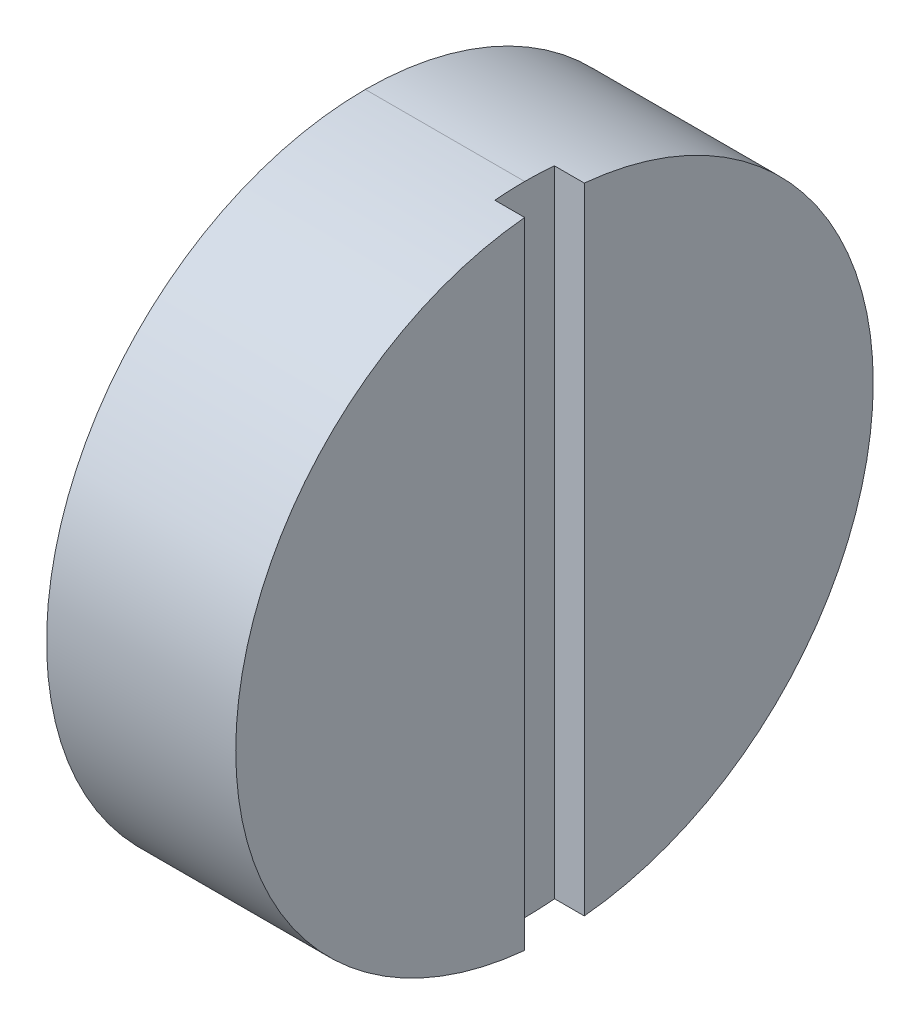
ISO-10303-21;
HEADER;
FILE_DESCRIPTION(('STEP AP214'),'2;1');
FILE_NAME('part.step','',(''),(''),'','','');
FILE_SCHEMA(('AUTOMOTIVE_DESIGN { 1 0 10303 214 1 1 1 1 }'));
ENDSEC;
DATA;
#1=APPLICATION_CONTEXT('core data for automotive mechanical design processes');
#2=APPLICATION_PROTOCOL_DEFINITION('international standard','automotive_design',2000,#1);
#3=PRODUCT_CONTEXT('',#1,'mechanical');
#4=PRODUCT('Part','Part','',(#3));
#5=PRODUCT_RELATED_PRODUCT_CATEGORY('part','',(#4));
#6=PRODUCT_DEFINITION_FORMATION('','',#4);
#7=PRODUCT_DEFINITION_CONTEXT('part definition',#1,'design');
#8=PRODUCT_DEFINITION('design','',#6,#7);
#9=PRODUCT_DEFINITION_SHAPE('','',#8);
#10=(LENGTH_UNIT() NAMED_UNIT(*) SI_UNIT(.MILLI.,.METRE.));
#11=(NAMED_UNIT(*) PLANE_ANGLE_UNIT() SI_UNIT($,.RADIAN.));
#12=(NAMED_UNIT(*) SI_UNIT($,.STERADIAN.) SOLID_ANGLE_UNIT());
#13=UNCERTAINTY_MEASURE_WITH_UNIT(LENGTH_MEASURE(1.E-05),#10,'distance_accuracy_value','');
#14=(GEOMETRIC_REPRESENTATION_CONTEXT(3) GLOBAL_UNCERTAINTY_ASSIGNED_CONTEXT((#13)) GLOBAL_UNIT_ASSIGNED_CONTEXT((#10,
#11,#12)) REPRESENTATION_CONTEXT('',''));
#15=CARTESIAN_POINT('',(0.,0.,0.));
#16=DIRECTION('',(0.,0.,1.));
#17=DIRECTION('',(1.,0.,0.));
#18=AXIS2_PLACEMENT_3D('',#15,#16,#17);
#19=CARTESIAN_POINT('',(43.1292,40.6146,14.605));
#20=DIRECTION('',(-1.,0.,0.));
#21=DIRECTION('',(0.,-1.,0.));
#22=AXIS2_PLACEMENT_3D('',#19,#20,#21);
#23=PLANE('',#22);
#24=CARTESIAN_POINT('',(43.1291999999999,35.179,15.113));
#25=DIRECTION('',(1.,0.,0.));
#26=DIRECTION('',(0.,1.,0.));
#27=AXIS2_PLACEMENT_3D('',#24,#25,#26);
#28=CIRCLE('',#27,5.4356);
#29=CARTESIAN_POINT('',(43.1291999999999,29.7671903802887,14.605));
#30=VERTEX_POINT('',#29);
#31=CARTESIAN_POINT('',(43.1291999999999,29.7434,15.113));
#32=VERTEX_POINT('',#31);
#33=EDGE_CURVE('E105',#30,#32,#28,.F.);
#34=ORIENTED_EDGE('',*,*,#33,.F.);
#35=DIRECTION('',(0.,1.,0.));
#36=VECTOR('',#35,1.);
#37=CARTESIAN_POINT('',(43.1291999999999,40.6146,14.605));
#38=LINE('',#37,#36);
#39=CARTESIAN_POINT('',(43.1291999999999,40.5908096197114,14.605));
#40=VERTEX_POINT('',#39);
#41=EDGE_CURVE('E92',#30,#40,#38,.T.);
#42=ORIENTED_EDGE('',*,*,#41,.T.);
#43=CARTESIAN_POINT('',(43.1291999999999,35.179,15.113));
#44=DIRECTION('',(1.,0.,0.));
#45=DIRECTION('',(0.,1.,0.));
#46=AXIS2_PLACEMENT_3D('',#43,#44,#45);
#47=CIRCLE('',#46,5.4356);
#48=CARTESIAN_POINT('',(43.1291999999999,40.6146,15.113));
#49=VERTEX_POINT('',#48);
#50=EDGE_CURVE('E70',#49,#40,#47,.F.);
#51=ORIENTED_EDGE('',*,*,#50,.F.);
#52=CARTESIAN_POINT('',(43.1291999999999,35.179,15.113));
#53=DIRECTION('',(1.,0.,0.));
#54=DIRECTION('',(0.,1.,0.));
#55=AXIS2_PLACEMENT_3D('',#52,#53,#54);
#56=CIRCLE('',#55,5.4356);
#57=CARTESIAN_POINT('',(43.1291999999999,40.5908096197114,15.621));
#58=VERTEX_POINT('',#57);
#59=EDGE_CURVE('E20',#58,#49,#56,.F.);
#60=ORIENTED_EDGE('',*,*,#59,.F.);
#61=DIRECTION('',(0.,1.,0.));
#62=VECTOR('',#61,1.);
#63=CARTESIAN_POINT('',(43.1292,29.7434000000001,15.621));
#64=LINE('',#63,#62);
#65=CARTESIAN_POINT('',(43.1291999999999,29.7671903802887,15.621));
#66=VERTEX_POINT('',#65);
#67=EDGE_CURVE('E68',#58,#66,#64,.F.);
#68=ORIENTED_EDGE('',*,*,#67,.T.);
#69=CARTESIAN_POINT('',(43.1291999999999,35.179,15.113));
#70=DIRECTION('',(1.,0.,0.));
#71=DIRECTION('',(0.,1.,0.));
#72=AXIS2_PLACEMENT_3D('',#69,#70,#71);
#73=CIRCLE('',#72,5.4356);
#74=EDGE_CURVE('E94',#32,#66,#73,.F.);
#75=ORIENTED_EDGE('',*,*,#74,.F.);
#76=EDGE_LOOP('',(#34,#42,#51,#60,#68,#75));
#77=FACE_BOUND('',#76,.T.);
#78=ADVANCED_FACE('F17',(#77),#23,.F.);
#79=CARTESIAN_POINT('',(43.6372,40.6146,14.605));
#80=DIRECTION('',(0.,0.,-1.));
#81=DIRECTION('',(-1.,0.,0.));
#82=AXIS2_PLACEMENT_3D('',#79,#80,#81);
#83=PLANE('',#82);
#84=DIRECTION('',(0.,1.,0.));
#85=VECTOR('',#84,1.);
#86=CARTESIAN_POINT('',(43.6371999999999,35.179,14.605));
#87=LINE('',#86,#85);
#88=CARTESIAN_POINT('',(43.6372,40.5908096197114,14.605));
#89=VERTEX_POINT('',#88);
#90=CARTESIAN_POINT('',(43.6371999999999,29.7671903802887,14.605));
#91=VERTEX_POINT('',#90);
#92=EDGE_CURVE('E115',#89,#91,#87,.F.);
#93=ORIENTED_EDGE('',*,*,#92,.F.);
#94=DIRECTION('',(-1.,0.,0.));
#95=VECTOR('',#94,1.);
#96=CARTESIAN_POINT('',(43.6372,40.5908096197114,14.605));
#97=LINE('',#96,#95);
#98=EDGE_CURVE('E87',#40,#89,#97,.F.);
#99=ORIENTED_EDGE('',*,*,#98,.F.);
#100=ORIENTED_EDGE('',*,*,#41,.F.);
#101=DIRECTION('',(-1.,0.,0.));
#102=VECTOR('',#101,1.);
#103=CARTESIAN_POINT('',(43.6372,29.7671903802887,14.605));
#104=LINE('',#103,#102);
#105=EDGE_CURVE('E84',#91,#30,#104,.T.);
#106=ORIENTED_EDGE('',*,*,#105,.F.);
#107=EDGE_LOOP('',(#93,#99,#100,#106));
#108=FACE_BOUND('',#107,.T.);
#109=ADVANCED_FACE('F113',(#108),#83,.F.);
#110=CARTESIAN_POINT('',(43.6371999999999,29.7434000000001,15.621));
#111=DIRECTION('',(0.,0.,1.));
#112=DIRECTION('',(1.,0.,0.));
#113=AXIS2_PLACEMENT_3D('',#110,#111,#112);
#114=PLANE('',#113);
#115=ORIENTED_EDGE('',*,*,#67,.F.);
#116=DIRECTION('',(1.,0.,0.));
#117=VECTOR('',#116,1.);
#118=CARTESIAN_POINT('',(43.6371999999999,40.5908096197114,15.621));
#119=LINE('',#118,#117);
#120=CARTESIAN_POINT('',(43.6372,40.5908096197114,15.621));
#121=VERTEX_POINT('',#120);
#122=EDGE_CURVE('E76',#121,#58,#119,.F.);
#123=ORIENTED_EDGE('',*,*,#122,.F.);
#124=DIRECTION('',(0.,1.,0.));
#125=VECTOR('',#124,1.);
#126=CARTESIAN_POINT('',(43.6371999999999,35.179,15.621));
#127=LINE('',#126,#125);
#128=CARTESIAN_POINT('',(43.6371999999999,29.7671903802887,15.621));
#129=VERTEX_POINT('',#128);
#130=EDGE_CURVE('E103',#129,#121,#127,.T.);
#131=ORIENTED_EDGE('',*,*,#130,.F.);
#132=DIRECTION('',(1.,0.,0.));
#133=VECTOR('',#132,1.);
#134=CARTESIAN_POINT('',(43.6371999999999,29.7671903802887,15.621));
#135=LINE('',#134,#133);
#136=EDGE_CURVE('E78',#66,#129,#135,.T.);
#137=ORIENTED_EDGE('',*,*,#136,.F.);
#138=EDGE_LOOP('',(#115,#123,#131,#137));
#139=FACE_BOUND('',#138,.T.);
#140=ADVANCED_FACE('F74',(#139),#114,.F.);
#141=CARTESIAN_POINT('',(43.6371999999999,35.179,15.113));
#142=DIRECTION('',(1.,0.,0.));
#143=DIRECTION('',(0.,1.,0.));
#144=AXIS2_PLACEMENT_3D('',#141,#142,#143);
#145=PLANE('',#144);
#146=ORIENTED_EDGE('',*,*,#92,.T.);
#147=CARTESIAN_POINT('',(43.6371999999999,35.179,15.113));
#148=DIRECTION('',(1.,0.,0.));
#149=DIRECTION('',(0.,1.,0.));
#150=AXIS2_PLACEMENT_3D('',#147,#148,#149);
#151=CIRCLE('',#150,5.4356);
#152=EDGE_CURVE('E100',#89,#91,#151,.F.);
#153=ORIENTED_EDGE('',*,*,#152,.F.);
#154=EDGE_LOOP('',(#146,#153));
#155=FACE_BOUND('',#154,.T.);
#156=ADVANCED_FACE('F120',(#155),#145,.T.);
#157=CARTESIAN_POINT('',(43.6371999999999,35.179,15.113));
#158=DIRECTION('',(1.,0.,0.));
#159=DIRECTION('',(0.,1.,0.));
#160=AXIS2_PLACEMENT_3D('',#157,#158,#159);
#161=PLANE('',#160);
#162=ORIENTED_EDGE('',*,*,#130,.T.);
#163=CARTESIAN_POINT('',(43.6371999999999,35.179,15.113));
#164=DIRECTION('',(1.,0.,0.));
#165=DIRECTION('',(0.,1.,0.));
#166=AXIS2_PLACEMENT_3D('',#163,#164,#165);
#167=CIRCLE('',#166,5.4356);
#168=EDGE_CURVE('E83',#129,#121,#167,.F.);
#169=ORIENTED_EDGE('',*,*,#168,.F.);
#170=EDGE_LOOP('',(#162,#169));
#171=FACE_BOUND('',#170,.T.);
#172=ADVANCED_FACE('F136',(#171),#161,.T.);
#173=CARTESIAN_POINT('',(43.6371999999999,35.179,15.113));
#174=DIRECTION('',(1.,0.,0.));
#175=DIRECTION('',(0.,1.,0.));
#176=AXIS2_PLACEMENT_3D('',#173,#174,#175);
#177=CYLINDRICAL_SURFACE('',#176,5.4356);
#178=ORIENTED_EDGE('',*,*,#105,.T.);
#179=ORIENTED_EDGE('',*,*,#33,.T.);
#180=DIRECTION('',(1.,0.,0.));
#181=VECTOR('',#180,1.);
#182=CARTESIAN_POINT('',(43.6371999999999,29.7434,15.113));
#183=LINE('',#182,#181);
#184=CARTESIAN_POINT('',(40.4113999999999,29.7434,15.113));
#185=VERTEX_POINT('',#184);
#186=EDGE_CURVE('E99',#185,#32,#183,.T.);
#187=ORIENTED_EDGE('',*,*,#186,.F.);
#188=CARTESIAN_POINT('',(40.4113999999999,35.179,15.113));
#189=DIRECTION('',(1.,0.,0.));
#190=DIRECTION('',(0.,1.,0.));
#191=AXIS2_PLACEMENT_3D('',#188,#189,#190);
#192=CIRCLE('',#191,5.4356);
#193=CARTESIAN_POINT('',(40.4114,40.6146,15.113));
#194=VERTEX_POINT('',#193);
#195=EDGE_CURVE('E26',#185,#194,#192,.T.);
#196=ORIENTED_EDGE('',*,*,#195,.T.);
#197=DIRECTION('',(1.,0.,0.));
#198=VECTOR('',#197,1.);
#199=CARTESIAN_POINT('',(43.6372,40.6146,15.113));
#200=LINE('',#199,#198);
#201=EDGE_CURVE('E34',#49,#194,#200,.F.);
#202=ORIENTED_EDGE('',*,*,#201,.F.);
#203=ORIENTED_EDGE('',*,*,#50,.T.);
#204=ORIENTED_EDGE('',*,*,#98,.T.);
#205=ORIENTED_EDGE('',*,*,#152,.T.);
#206=EDGE_LOOP('',(#178,#179,#187,#196,#202,#203,#204,#205));
#207=FACE_BOUND('',#206,.T.);
#208=ADVANCED_FACE('F109',(#207),#177,.T.);
#209=CARTESIAN_POINT('',(43.6371999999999,35.179,15.113));
#210=DIRECTION('',(1.,0.,0.));
#211=DIRECTION('',(0.,1.,0.));
#212=AXIS2_PLACEMENT_3D('',#209,#210,#211);
#213=CYLINDRICAL_SURFACE('',#212,5.4356);
#214=ORIENTED_EDGE('',*,*,#201,.T.);
#215=CARTESIAN_POINT('',(40.4113999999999,35.179,15.113));
#216=DIRECTION('',(1.,0.,0.));
#217=DIRECTION('',(0.,1.,0.));
#218=AXIS2_PLACEMENT_3D('',#215,#216,#217);
#219=CIRCLE('',#218,5.4356);
#220=EDGE_CURVE('E11',#194,#185,#219,.T.);
#221=ORIENTED_EDGE('',*,*,#220,.T.);
#222=ORIENTED_EDGE('',*,*,#186,.T.);
#223=ORIENTED_EDGE('',*,*,#74,.T.);
#224=ORIENTED_EDGE('',*,*,#136,.T.);
#225=ORIENTED_EDGE('',*,*,#168,.T.);
#226=ORIENTED_EDGE('',*,*,#122,.T.);
#227=ORIENTED_EDGE('',*,*,#59,.T.);
#228=EDGE_LOOP('',(#214,#221,#222,#223,#224,#225,#226,#227));
#229=FACE_BOUND('',#228,.T.);
#230=ADVANCED_FACE('F81',(#229),#213,.T.);
#231=CARTESIAN_POINT('',(40.4113999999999,29.7434000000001,15.113));
#232=DIRECTION('',(1.,0.,0.));
#233=DIRECTION('',(0.,1.,0.));
#234=AXIS2_PLACEMENT_3D('',#231,#232,#233);
#235=PLANE('',#234);
#236=ORIENTED_EDGE('',*,*,#195,.F.);
#237=ORIENTED_EDGE('',*,*,#220,.F.);
#238=EDGE_LOOP('',(#236,#237));
#239=FACE_BOUND('',#238,.T.);
#240=ADVANCED_FACE('F125',(#239),#235,.F.);
#241=CLOSED_SHELL('',(#78,#109,#140,#156,#172,#208,#230,#240));
#242=MANIFOLD_SOLID_BREP('B1',#241);
#243=ADVANCED_BREP_SHAPE_REPRESENTATION('',(#18,#242),#14);
#244=SHAPE_DEFINITION_REPRESENTATION(#9,#243);
ENDSEC;
END-ISO-10303-21;
